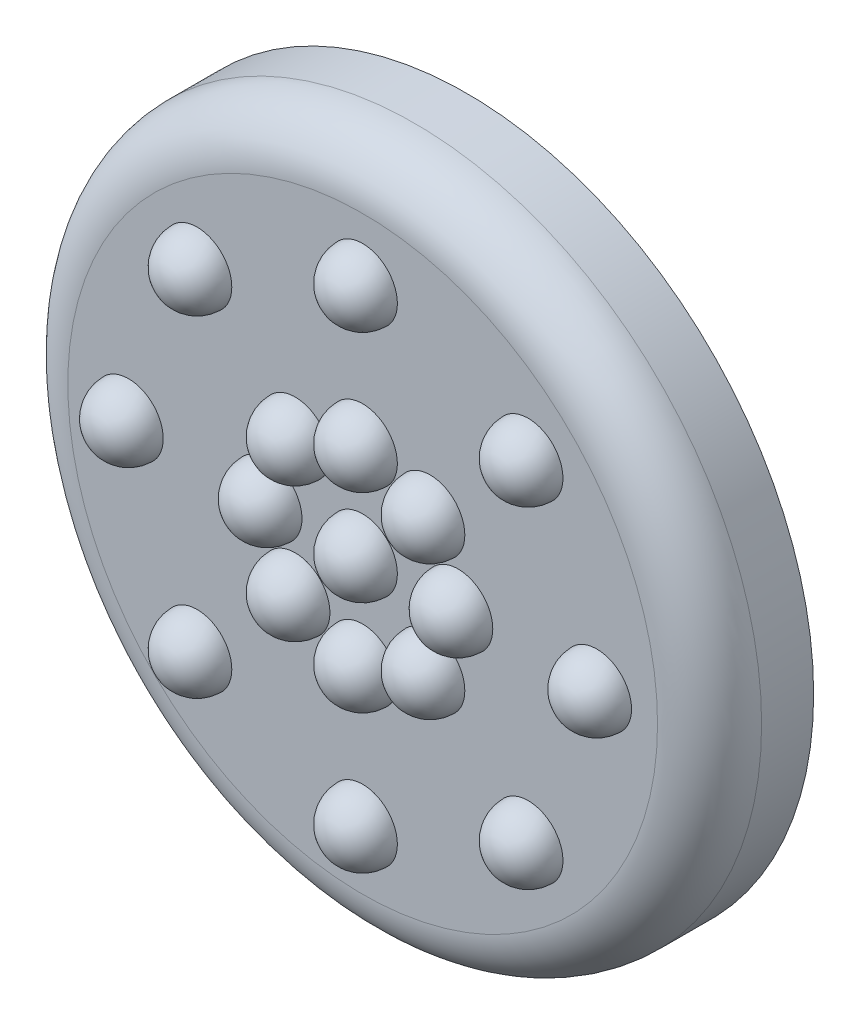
from build123d import *

# Parameters (mm, degrees)
SKETCH1_R           = 100
BOSS_EXTRUDE1_DEPTH = 30
FILLET1_R           = 15
LPATTERN1_COUNT     = 2
LPATTERN1_PITCH     = 40
CIRPATTERN2_COUNT   = 8


with BuildPart() as part:
    # Sketch1 → Boss-Extrude1 (new body)
    with BuildSketch(Plane.XY):
        Circle(SKETCH1_R)
    extrude(amount=BOSS_EXTRUDE1_DEPTH)

    # Fillet1
    fillet1_edges = [part.edges().sort_by_distance(p)[0] for p in [
        (-100, 0, 30),
    ]]
    fillet(fillet1_edges, radius=FILLET1_R)

    # Sketch2 → Revolve2 (revolve)
    with BuildSketch(Plane.XY.offset(30)):
        with BuildLine():
            Line((-10, -67.5), (10, -67.5))
            ThreePointArc((10, -67.5), (0, -77.5), (-10, -67.5))
        make_face()
    revolve2 = revolve(axis=Axis((-10, -67.5, 30), (1, 0, 0)))

    # LPattern1: Revolve2 ×2
    with Locations(*[(0, i * LPATTERN1_PITCH, 0) for i in range(1, LPATTERN1_COUNT)]):
        add(revolve2)

    # CirPattern2: Revolve2 ×8 about axis
    cirpattern2_axis = Axis((0, 0, 0), (0, 0, 1))
    for i in range(1, CIRPATTERN2_COUNT):
        add(revolve2.rotate(cirpattern2_axis, i * 360 / CIRPATTERN2_COUNT))

    # CirPattern2 copy 1 sketch → CirPattern2 copy 1 (revolve)
    with BuildSketch(Plane(origin=(-28.284271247, 28.284271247, 30), x_dir=(0.7071067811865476, 0.7071067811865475, 0), z_dir=(0, 0, 1))):
        with BuildLine():
            Line((-10, -67.5), (10, -67.5))
            ThreePointArc((10, -67.5), (0, -77.5), (-10, -67.5))
        make_face()
    revolve(axis=Axis((12.374368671, -26.516504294, 30), (0.7071067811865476, 0.7071067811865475, 0)))

    # CirPattern2 copy 2 sketch → CirPattern2 copy 2 (revolve)
    with BuildSketch(Plane(origin=(-40, 0, 30), x_dir=(0, 1, 0), z_dir=(0, 0, 1))):
        with BuildLine():
            Line((-10, -67.5), (10, -67.5))
            ThreePointArc((10, -67.5), (0, -77.5), (-10, -67.5))
        make_face()
    revolve(axis=Axis((27.5, -10, 30), (0, 1, 0)))

    # CirPattern2 copy 3 sketch → CirPattern2 copy 3 (revolve)
    with BuildSketch(Plane(origin=(-28.284271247, -28.284271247, 30), x_dir=(-0.7071067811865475, 0.7071067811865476, 0), z_dir=(0, 0, 1))):
        with BuildLine():
            Line((-10, -67.5), (10, -67.5))
            ThreePointArc((10, -67.5), (0, -77.5), (-10, -67.5))
        make_face()
    revolve(axis=Axis((26.516504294, 12.374368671, 30), (-0.7071067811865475, 0.7071067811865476, 0)))

    # CirPattern2 copy 4 sketch → CirPattern2 copy 4 (revolve)
    with BuildSketch(Plane(origin=(0, -40, 30), x_dir=(-1, 0, 0), z_dir=(0, 0, 1))):
        with BuildLine():
            Line((-10, -67.5), (10, -67.5))
            ThreePointArc((10, -67.5), (0, -77.5), (-10, -67.5))
        make_face()
    revolve(axis=Axis((10, 27.5, 30), (-1, 0, 0)))

    # CirPattern2 copy 5 sketch → CirPattern2 copy 5 (revolve)
    with BuildSketch(Plane(origin=(28.284271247, -28.284271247, 30), x_dir=(-0.7071067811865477, -0.7071067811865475, 0), z_dir=(0, 0, 1))):
        with BuildLine():
            Line((-10, -67.5), (10, -67.5))
            ThreePointArc((10, -67.5), (0, -77.5), (-10, -67.5))
        make_face()
    revolve(axis=Axis((-12.374368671, 26.516504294, 30), (-0.7071067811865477, -0.7071067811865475, 0)))

    # CirPattern2 copy 6 sketch → CirPattern2 copy 6 (revolve)
    with BuildSketch(Plane(origin=(40, 0, 30), x_dir=(0, -1, 0), z_dir=(0, 0, 1))):
        with BuildLine():
            Line((-10, -67.5), (10, -67.5))
            ThreePointArc((10, -67.5), (0, -77.5), (-10, -67.5))
        make_face()
    revolve(axis=Axis((-27.5, 10, 30), (0, -1, 0)))

    # CirPattern2 copy 7 sketch → CirPattern2 copy 7 (revolve)
    with BuildSketch(Plane(origin=(28.284271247, 28.284271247, 30), x_dir=(0.7071067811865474, -0.7071067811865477, 0), z_dir=(0, 0, 1))):
        with BuildLine():
            Line((-10, -67.5), (10, -67.5))
            ThreePointArc((10, -67.5), (0, -77.5), (-10, -67.5))
        make_face()
    revolve(axis=Axis((-26.516504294, -12.374368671, 30), (0.7071067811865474, -0.7071067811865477, 0)))

    # Sketch6 → Revolve3 (revolve)
    with BuildSketch(Plane.XY.offset(30)):
        with BuildLine():
            Line((10, 0), (-10, 0))
            ThreePointArc((-10, 0), (0, -10), (10, 0))
        make_face()
    revolve(axis=Axis((10, 0, 30), (-1, 0, 0)))


solid = part.part
